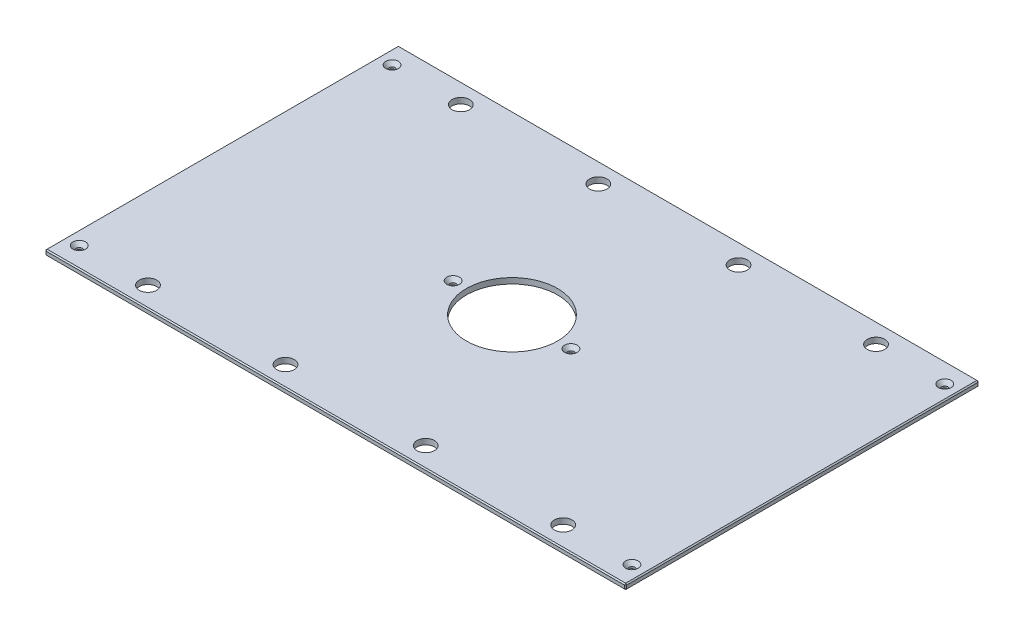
from build123d import *

# Parameters (mm, degrees)
SKETCH1_W                                     = 657.225
SKETCH1_H                                     = 400.05
BOSS_EXTRUDE1_DEPTH                           = 6.35
SKETCH13_R                                    = 51.562
CUT_EXTRUDE6_DEPTH                            = 385.755114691
F_25_32_0_78125_DIAMETER_HOLE1_D              = 19.84375
CHAMFER2_SIZE                                 = 1.27
CSK_FOR_1_4_FLAT_HEAD_MACHINE_SCREW1_AT_COUNT = 2
CSK_FOR_1_4_FLAT_HEAD_MACHINE_SCREW1_AT_PITCH = 354.00996
CSK_FOR_1_4_FLAT_HEAD_MACHINE_SCREW1_2_COUNT  = 2
CSK_FOR_1_4_FLAT_HEAD_MACHINE_SCREW1_2_PITCH  = 718.708583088
CSK_FOR_1_4_FLAT_HEAD_MACHINE_SCREW1_3_COUNT  = 2
CSK_FOR_1_4_FLAT_HEAD_MACHINE_SCREW1_3_PITCH  = 418.670046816
CSK_FOR_1_4_FLAT_HEAD_MACHINE_SCREW1_4_COUNT  = 2
CSK_FOR_1_4_FLAT_HEAD_MACHINE_SCREW1_4_PITCH  = 303.113043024
CSK_FOR_1_4_FLAT_HEAD_MACHINE_SCREW1_5_COUNT  = 2
CSK_FOR_1_4_FLAT_HEAD_MACHINE_SCREW1_5_PITCH  = 625.475
CSK_FOR_1_4_FLAT_HEAD_MACHINE_SCREW1_6_COUNT  = 2
CSK_FOR_1_4_FLAT_HEAD_MACHINE_SCREW1_6_PITCH  = 547.6875
CSK_FOR_1_4_FLAT_HEAD_MACHINE_SCREW1_7_COUNT  = 2
CSK_FOR_1_4_FLAT_HEAD_MACHINE_SCREW1_7_PITCH  = 652.138520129


with BuildPart() as part:
    # Sketch1 → Boss-Extrude1 (new body)
    with BuildSketch(Plane(origin=(0, 0, 0), x_dir=(1, 0, 0), z_dir=(0, 1, 0))):
        Rectangle(SKETCH1_W, SKETCH1_H)
    extrude(amount=BOSS_EXTRUDE1_DEPTH)

    # Sketch13 → Cut-Extrude6 (cut, through all)
    with BuildSketch(Plane(origin=(0, 6.35, 0), x_dir=(1, 0, 0), z_dir=(0, 1, 0))):
        with Locations(Location((0, 0, 0), (0, 0, 270))):
            Circle(SKETCH13_R)
    extrude(amount=-CUT_EXTRUDE6_DEPTH, mode=Mode.SUBTRACT)

    # 25_32 _0.78125_ Diameter Hole1 (through all)
    with Locations(Plane(origin=(0, 6.35, 0), x_dir=(1, 0, 0), z_dir=(0, 1, 0))):
        with Locations((234.95, 177.00498), (-234.95, 177.00498), (234.95, -177.00498), (-234.95, -177.00498), (-79.375, 177.00498), (79.375, 177.00498), (79.375, -177.00498), (-79.375, -177.00498)):
            Hole(F_25_32_0_78125_DIAMETER_HOLE1_D / 2)

    # Chamfer2
    chamfer2_edges = [part.edges().sort_by_distance(p)[0] for p in [
        (328.6125, 6.35, 0),
        (0, 6.35, -200.025),
        (-328.6125, 6.35, 0),
        (0, 0, -200.025),
        (328.6125, 0, 0),
        (0, 0, 200.025),
        (-328.6125, 0, 0),
        (0, 6.35, 200.025),
        (-328.6125, 3.175, -200.025),
        (328.6125, 3.175, -200.025),
        (328.6125, 3.175, 200.025),
        (-328.6125, 3.175, 200.025),
    ]]
    chamfer(chamfer2_edges, length=CHAMFER2_SIZE)

    # Sketch24 → CSK for 1_4 Flat Head Machine Screw1 (revolve, cut)
    with BuildSketch(Plane(origin=(312.7375, 6.35, -177.00498), x_dir=(0, 0, 1), z_dir=(1, 0, 0))):
        Polygon((0, 0), (0, 6.35), (3.3782, 6.35), (3.3782, 4.324464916), (7.1374, 0), align=None)
    csk_for_1_4_flat_head_machine_screw1 = revolve(axis=Axis((312.7375, 12.7, -177.00498), (0, -1, 0)), mode=Mode.SUBTRACT)

    # CSK for 1_4 Flat Head Machine Screw1 at: CSK for 1_4 Flat Head Machine Screw1 ×2
    with Locations(*[(0, 0, i * CSK_FOR_1_4_FLAT_HEAD_MACHINE_SCREW1_AT_PITCH) for i in range(1, CSK_FOR_1_4_FLAT_HEAD_MACHINE_SCREW1_AT_COUNT)]):
        add(csk_for_1_4_flat_head_machine_screw1, mode=Mode.SUBTRACT)

    # CSK for 1_4 Flat Head Machine Screw1 2: CSK for 1_4 Flat Head Machine Screw1 ×2
    with Locations(*[Vector(-0.8702762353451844, 0, 0.49256397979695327) * (i * CSK_FOR_1_4_FLAT_HEAD_MACHINE_SCREW1_2_PITCH) for i in range(1, CSK_FOR_1_4_FLAT_HEAD_MACHINE_SCREW1_2_COUNT)]):
        add(csk_for_1_4_flat_head_machine_screw1, mode=Mode.SUBTRACT)

    # CSK for 1_4 Flat Head Machine Screw1 3: CSK for 1_4 Flat Head Machine Screw1 ×2
    with Locations(*[Vector(-0.9062327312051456, 0, 0.42277918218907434) * (i * CSK_FOR_1_4_FLAT_HEAD_MACHINE_SCREW1_3_PITCH) for i in range(1, CSK_FOR_1_4_FLAT_HEAD_MACHINE_SCREW1_3_COUNT)]):
        add(csk_for_1_4_flat_head_machine_screw1, mode=Mode.SUBTRACT)

    # CSK for 1_4 Flat Head Machine Screw1 4: CSK for 1_4 Flat Head Machine Screw1 ×2
    with Locations(*[Vector(-0.8117845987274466, 0, 0.5839569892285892) * (i * CSK_FOR_1_4_FLAT_HEAD_MACHINE_SCREW1_4_PITCH) for i in range(1, CSK_FOR_1_4_FLAT_HEAD_MACHINE_SCREW1_4_COUNT)]):
        add(csk_for_1_4_flat_head_machine_screw1, mode=Mode.SUBTRACT)

    # CSK for 1_4 Flat Head Machine Screw1 5: CSK for 1_4 Flat Head Machine Screw1 ×2
    with Locations(*[(-i * CSK_FOR_1_4_FLAT_HEAD_MACHINE_SCREW1_5_PITCH, 0, 0) for i in range(1, CSK_FOR_1_4_FLAT_HEAD_MACHINE_SCREW1_5_COUNT)]):
        add(csk_for_1_4_flat_head_machine_screw1, mode=Mode.SUBTRACT)

    # CSK for 1_4 Flat Head Machine Screw1 6: CSK for 1_4 Flat Head Machine Screw1 ×2
    with Locations(*[(-i * CSK_FOR_1_4_FLAT_HEAD_MACHINE_SCREW1_6_PITCH, 0, 0) for i in range(1, CSK_FOR_1_4_FLAT_HEAD_MACHINE_SCREW1_6_COUNT)]):
        add(csk_for_1_4_flat_head_machine_screw1, mode=Mode.SUBTRACT)

    # CSK for 1_4 Flat Head Machine Screw1 7: CSK for 1_4 Flat Head Machine Screw1 ×2
    with Locations(*[Vector(-0.839833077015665, 0, 0.5428447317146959) * (i * CSK_FOR_1_4_FLAT_HEAD_MACHINE_SCREW1_7_PITCH) for i in range(1, CSK_FOR_1_4_FLAT_HEAD_MACHINE_SCREW1_7_COUNT)]):
        add(csk_for_1_4_flat_head_machine_screw1, mode=Mode.SUBTRACT)


solid = part.part
